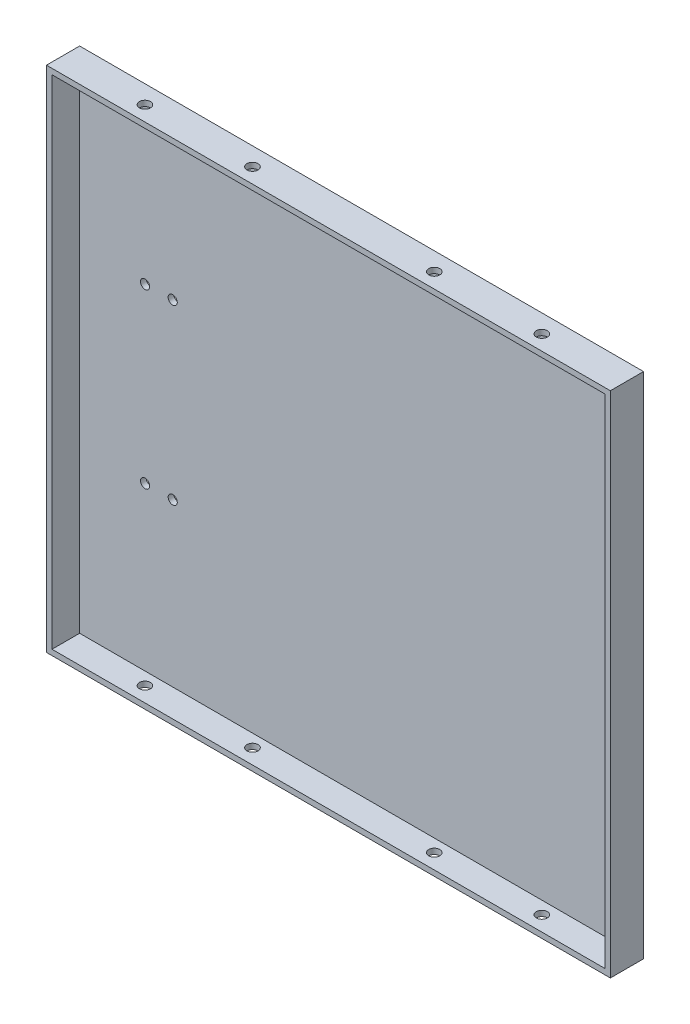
from build123d import *

# Parameters (mm, degrees)
SKETCH_1_W          = 204
SKETCH_1_H          = 184
EXTRUDE_1_DEPTH     = 12
SKETCH_2_W          = 200
SKETCH_2_H          = 180
CUT_EXTRUDE_1_DEPTH = 10
SKETCH_3_R          = 2
CUT_EXTRUDE_2_DEPTH = 10
SKETCH_4_R          = 1.65
CUT_EXTRUDE_3_DEPTH = 20


with BuildPart() as part:
    # Sketch 1 → Extrude 1 (new body)
    with BuildSketch(Plane.XY):
        Rectangle(SKETCH_1_W, SKETCH_1_H)
    extrude(amount=EXTRUDE_1_DEPTH)

    # Sketch 2 → Cut-Extrude 1 (cut)
    with BuildSketch(Plane.XY.offset(12)):
        Rectangle(SKETCH_2_W, SKETCH_2_H)
    extrude(amount=-CUT_EXTRUDE_1_DEPTH, mode=Mode.SUBTRACT)

    # Sketch 3 → Cut-Extrude 2 (cut)
    with BuildSketch(Plane.XZ.offset(92)):
        with Locations(Location((-71.793458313, 6.584424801, 0), (0, 0, 270))):
            Circle(SKETCH_3_R)
        with Locations(Location((-32.883189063, 6.584424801, 0), (0, 0, 270))):
            Circle(SKETCH_3_R)
        with Locations(Location((32.883189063, 6.584424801, 0), (0, 0, 270))):
            Circle(SKETCH_3_R)
        with Locations(Location((71.793458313, 6.584424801, 0), (0, 0, 270))):
            Circle(SKETCH_3_R)
    cut_extrude_2 = extrude(amount=-CUT_EXTRUDE_2_DEPTH, mode=Mode.SUBTRACT)

    # Mirror 1: Cut-Extrude 2 across plane
    add(cut_extrude_2.mirror(Plane.ZX), mode=Mode.SUBTRACT)

    # Sketch 4 → Cut-Extrude 3 (cut)
    with BuildSketch(Plane(origin=(0, 0, 0), x_dir=(-1, 0, 0), z_dir=(0, 0, -1))):
        with Locations((76.328134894, -31.2)):
            Circle(SKETCH_4_R)
        with Locations((66.328634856, -31.299995)):
            Circle(SKETCH_4_R)
        with Locations((76.328134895, 31.2)):
            Circle(SKETCH_4_R)
        with Locations((66.328634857, 31.299995)):
            Circle(SKETCH_4_R)
    extrude(amount=-CUT_EXTRUDE_3_DEPTH, mode=Mode.SUBTRACT)


solid = part.part
